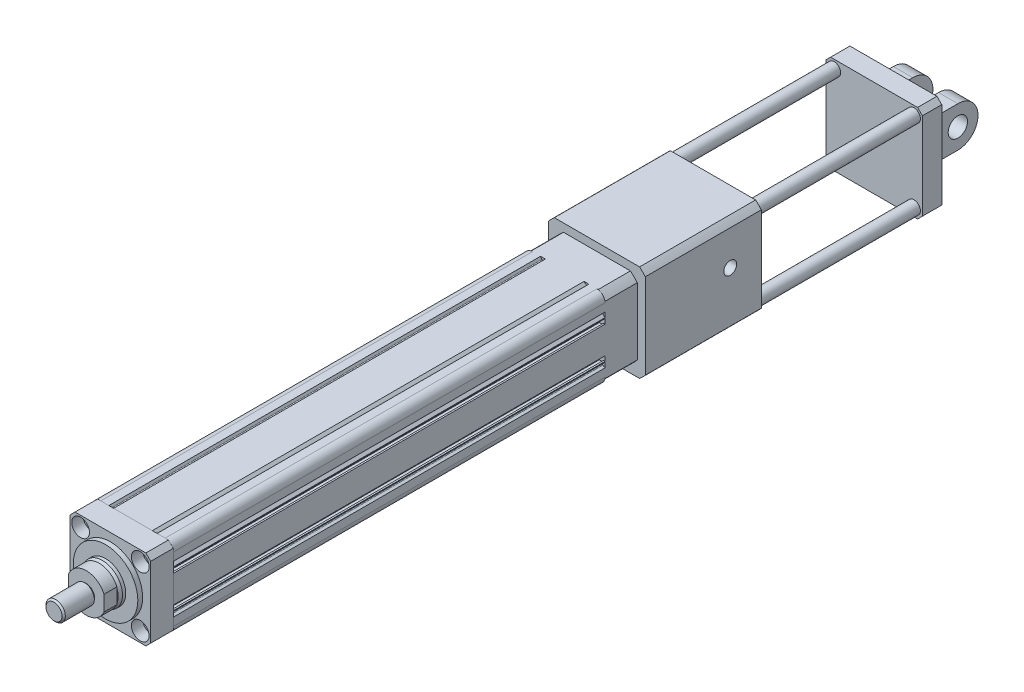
from build123d import *

# Parameters (mm, degrees)
SKETCH_1_R                  = 20
SKETCH_1_R_2                = 2.75
EXTRUDE_1_DEPTH             = 268
FILLET_1_R                  = 5
EXTRUDE_2_DEPTH             = 14
SKETCH_3_R                  = 20
EXTRUDE_3_DEPTH             = 3
SKETCH_5_R                  = 12.5
EXTRUDE_4_DEPTH             = 4
CHAMFER_1_SIZE              = 2
CHAMFER_1_SIZE2             = 0.7
EXTRUDE_5_DEPTH             = 8
SKETCH_7_R                  = 5.15
EXTRUDE_6_DEPTH             = 1
SKETCH_8_R                  = 6
EXTRUDE_7_DEPTH             = 19
CHAMFER_2_SIZE              = 1
SKETCH_23_W                 = 50
SKETCH_23_H                 = 50
EXTRUDE_8_DEPTH             = 20
SKETCH_24_R                 = 42.5
SKETCH_24_R_2               = 32.5
CUT_EXTRUDE_1_DEPTH         = 20
SKETCH_28_W                 = 60
SKETCH_28_H                 = 60
EXTRUDE_9_DEPTH             = 72
SKETCH_4_R                  = 3.5
CUT_EXTRUDE_5_DEPTH         = 30
SKETCH_4_6_R                = 5.5
CUT_EXTRUDE_6_DEPTH         = 7
CUT_EXTRUDE_START           = -72
SKETCH_30_R                 = 3.5
CUT_EXTRUDE_7_DEPTH         = 72
SKETCH_30_4_R               = 5.5
CUT_EXTRUDE_8_DEPTH         = 50
HOLE_WIZARD_M5_1_AT_2_COUNT = 2
HOLE_WIZARD_M5_1_AT_2_PITCH = 49.497474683
HOLE_WIZARD_M5_1_AT_3_COUNT = 2
HOLE_WIZARD_M5_1_AT_3_PITCH = 70
HOLE_WIZARD_M5_1_AT_4_COUNT = 2
HOLE_WIZARD_M5_1_AT_4_PITCH = 49.497474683
SKETCH_33_R                 = 19
CUT_EXTRUDE_9_DEPTH         = 65
SKETCH_33_3_R               = 25
CUT_EXTRUDE_10_DEPTH        = 6.5
SKETCH_34_R                 = 50
SKETCH_34_R_2               = 40
CUT_EXTRUDE_2_DEPTH         = 72
SKETCH_35_R                 = 4
CUT_EXTRUDE_11_DEPTH        = 22
SKETCH_36_R                 = 4
CUT_EXTRUDE_12_DEPTH        = 22
EXTRUDE_START               = 100
SKETCH_38_W                 = 60
SKETCH_38_H                 = 60
EXTRUDE_10_DEPTH            = 12
SKETCH_39_R                 = 4
EXTRUDE_11_DEPTH            = 112
EXTRUDE_11_2_DEPTH          = 112
EXTRUDE_11_3_DEPTH          = 112
EXTRUDE_11_4_DEPTH          = 112
EXTRUDE_12_DEPTH            = 1
SKETCH_41_W                 = 12
SKETCH_41_H                 = 25
EXTRUDE_13_DEPTH            = 32.5
SKETCH_42_R                 = 6
CUT_EXTRUDE_13_DEPTH        = 50
CHAMFER_3_SIZE              = 2
CHAMFER_4_SIZE              = 3


with BuildPart() as part:
    # Sketch 1 → Extrude 1 (new body)
    with BuildSketch(Plane.XY):
        with BuildLine():
            Line((-25, 25), (-15, 25))
            Line((-15, 25), (-14.227730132, 23.662389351))
            ThreePointArc((-14.227730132, 23.662389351), (-13.859980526, 23.416666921), (-13.441164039, 23.558835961))
            Line((-13.441164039, 23.558835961), (-12, 25))
            Line((-12, 25), (12, 25))
            Line((12, 25), (13.441164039, 23.558835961))
            ThreePointArc((13.441164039, 23.558835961), (13.859980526, 23.416666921), (14.227730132, 23.662389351))
            Line((14.227730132, 23.662389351), (15, 25))
            Line((15, 25), (25, 25))
            Line((25, 25), (25, 15))
            Line((25, 15), (23.662389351, 14.227730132))
            ThreePointArc((23.662389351, 14.227730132), (23.416666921, 13.859980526), (23.558835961, 13.441164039))
            Line((23.558835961, 13.441164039), (25, 12))
            Line((25, 12), (25, 11.5))
            Line((25, 11.5), (24, 11.5))
            Line((24, 11.5), (24, 12.4))
            Line((24, 12.4), (21.5, 12.4))
            Line((21.5, 12.4), (21.5, 7.6))
            Line((21.5, 7.6), (24, 7.6))
            Line((24, 7.6), (24, 8.5))
            Line((24, 8.5), (25, 8.5))
            Line((25, 8.5), (25, -8.5))
            Line((25, -8.5), (24, -8.5))
            Line((24, -8.5), (24, -7.6))
            Line((24, -7.6), (21.5, -7.6))
            Line((21.5, -7.6), (21.5, -12.4))
            Line((21.5, -12.4), (24, -12.4))
            Line((24, -12.4), (24, -11.5))
            Line((24, -11.5), (25, -11.5))
            Line((25, -11.5), (25, -12))
            Line((25, -12), (23.558835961, -13.441164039))
            ThreePointArc((23.558835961, -13.441164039), (23.416666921, -13.859980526), (23.662389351, -14.227730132))
            Line((23.662389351, -14.227730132), (25, -15))
            Line((25, -15), (25, -25))
            Line((25, -25), (15, -25))
            Line((15, -25), (14.227730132, -23.662389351))
            ThreePointArc((14.227730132, -23.662389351), (13.859980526, -23.416666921), (13.441164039, -23.558835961))
            Line((13.441164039, -23.558835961), (12, -25))
            Line((12, -25), (11.5, -25))
            Line((11.5, -25), (11.5, -24))
            Line((11.5, -24), (12.4, -24))
            Line((12.4, -24), (12.4, -21.5))
            Line((12.4, -21.5), (7.6, -21.5))
            Line((7.6, -21.5), (7.6, -24))
            Line((7.6, -24), (8.5, -24))
            Line((8.5, -24), (8.5, -25))
            Line((8.5, -25), (-8.5, -25))
            Line((-8.5, -25), (-8.5, -24))
            Line((-8.5, -24), (-7.6, -24))
            Line((-7.6, -24), (-7.6, -21.5))
            Line((-7.6, -21.5), (-12.4, -21.5))
            Line((-12.4, -21.5), (-12.4, -24))
            Line((-12.4, -24), (-11.5, -24))
            Line((-11.5, -24), (-11.5, -25))
            Line((-11.5, -25), (-12, -25))
            Line((-12, -25), (-13.441164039, -23.558835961))
            ThreePointArc((-13.441164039, -23.558835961), (-13.859980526, -23.416666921), (-14.227730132, -23.662389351))
            Line((-14.227730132, -23.662389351), (-15, -25))
            Line((-15, -25), (-25, -25))
            Line((-25, -25), (-25, -15))
            Line((-25, -15), (-23.662389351, -14.227730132))
            ThreePointArc((-23.662389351, -14.227730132), (-23.416666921, -13.859980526), (-23.558835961, -13.441164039))
            Line((-23.558835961, -13.441164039), (-25, -12))
            Line((-25, -12), (-25, -11.5))
            Line((-25, -11.5), (-24, -11.5))
            Line((-24, -11.5), (-24, -12.4))
            Line((-24, -12.4), (-21.5, -12.4))
            Line((-21.5, -12.4), (-21.5, -7.6))
            Line((-21.5, -7.6), (-24, -7.6))
            Line((-24, -7.6), (-24, -8.5))
            Line((-24, -8.5), (-25, -8.5))
            Line((-25, -8.5), (-25, 8.5))
            Line((-25, 8.5), (-24, 8.5))
            Line((-24, 8.5), (-24, 7.6))
            Line((-24, 7.6), (-21.5, 7.6))
            Line((-21.5, 7.6), (-21.5, 12.4))
            Line((-21.5, 12.4), (-24, 12.4))
            Line((-24, 12.4), (-24, 11.5))
            Line((-24, 11.5), (-25, 11.5))
            Line((-25, 11.5), (-25, 12))
            Line((-25, 12), (-23.558835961, 13.441164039))
            ThreePointArc((-23.558835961, 13.441164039), (-23.416666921, 13.859980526), (-23.662389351, 14.227730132))
            Line((-23.662389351, 14.227730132), (-25, 15))
            Line((-25, 15), (-25, 25))
        make_face()
        Circle(SKETCH_1_R, mode=Mode.SUBTRACT)
        with Locations((-18.5, 18.5)):
            Circle(SKETCH_1_R_2, mode=Mode.SUBTRACT)
        with Locations((18.5, 18.5)):
            Circle(SKETCH_1_R_2, mode=Mode.SUBTRACT)
        with Locations((18.5, -18.5)):
            Circle(SKETCH_1_R_2, mode=Mode.SUBTRACT)
        with Locations((-18.5, -18.5)):
            Circle(SKETCH_1_R_2, mode=Mode.SUBTRACT)
        with BuildLine():
            Line((-13.868836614, 23), (-5, 23))
            ThreePointArc((-5, 23), (-4.502985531, 22.554558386), (-4.891534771, 22.01190647))
            ThreePointArc((-4.891534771, 22.01190647), (-10.498377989, 19.955831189), (-15.368836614, 16.5))
            Line((-15.368836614, 16.5), (-15.368836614, 21.5))
            Line((-15.368836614, 21.5), (-13.868836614, 23))
        make_face(mode=Mode.SUBTRACT)
        with BuildLine():
            Line((15.368836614, 16.5), (15.368836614, 21.5))
            Line((15.368836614, 21.5), (13.868836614, 23))
            Line((13.868836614, 23), (5, 23))
            ThreePointArc((5, 23), (4.502985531, 22.554558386), (4.891534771, 22.01190647))
            ThreePointArc((4.891534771, 22.01190647), (10.498377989, 19.955831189), (15.368836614, 16.5))
        make_face(mode=Mode.SUBTRACT)
    extrude(amount=EXTRUDE_1_DEPTH)

    # Fillet 1
    fillet_1_edges = [part.edges().sort_by_distance(p)[0] for p in [
        (-25, 25, 134),
        (25, 25, 134),
        (25, -25, 134),
        (-25, -25, 134),
    ]]
    fillet(fillet_1_edges, radius=FILLET_1_R)

    # Sketch 23 → Extrude 8 (add)
    with BuildSketch(Plane(origin=(0, 0, 0), x_dir=(-1, 0, 0), z_dir=(0, 0, -1))):
        Rectangle(SKETCH_23_W, SKETCH_23_H)
    extrude(amount=EXTRUDE_8_DEPTH)

    # Sketch 24 → Cut-Extrude 1 (cut)
    with BuildSketch(Plane(origin=(0, 0, -20), x_dir=(-1, 0, 0), z_dir=(0, 0, -1))):
        Circle(SKETCH_24_R)
        Circle(SKETCH_24_R_2, mode=Mode.SUBTRACT)
    extrude(amount=-CUT_EXTRUDE_1_DEPTH, mode=Mode.SUBTRACT)

    # Sketch 27 → Hole Wizard M6 _1 (revolve, cut)
    with BuildSketch(Plane(origin=(0, -25, -12), x_dir=(0, 0, -1), z_dir=(1, 0, 0))):
        Polygon((0, 0), (0, 8.502151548), (2.5, 7), (2.5, 0), align=None)
    revolve(axis=Axis((0, -31.35, -12), (0, 1, 0)), mode=Mode.SUBTRACT)


with BuildPart() as body_2:
    # Sketch 2 → Extrude 2 (new body)
    with BuildSketch(Plane.XY.offset(268)):
        Polygon((-25, 22), (-22, 25), (22, 25), (25, 22), (25, -22), (22, -25), (-22, -25), (-25, -22), align=None)
    extrude(amount=EXTRUDE_2_DEPTH)


with BuildPart() as body_3:
    # Sketch 3 → Extrude 3 (new body)
    with BuildSketch(Plane.XY.offset(282)):
        Circle(SKETCH_3_R)
    extrude(amount=EXTRUDE_3_DEPTH)


with BuildPart() as body_4:
    # Sketch 5 → Extrude 4 (new body)
    with BuildSketch(Plane.XY.offset(285)):
        Circle(SKETCH_5_R)
    extrude(amount=EXTRUDE_4_DEPTH)

    # Chamfer 1
    chamfer_1_edges = [body_4.edges().sort_by_distance(p)[0] for p in [
        (-12.5, 0, 289),
    ]]
    chamfer_1_side = [body_4.faces().sort_by_distance(p)[0] for p in [
        (-12.5, 0, 287),
    ]]
    chamfer(chamfer_1_edges, length=CHAMFER_1_SIZE, length2=CHAMFER_1_SIZE2, reference=chamfer_1_side[0])


with BuildPart() as body_5:
    # Sketch 6 → Extrude 5 (new body)
    with BuildSketch(Plane.XY.offset(289)):
        with BuildLine():
            Line((-11, 4.795831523), (-11, -4.795831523))
            ThreePointArc((-11, -4.795831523), (0, -12), (11, -4.795831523))
            Line((11, -4.795831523), (11, 4.795831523))
            ThreePointArc((11, 4.795831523), (0, 12), (-11, 4.795831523))
        make_face()
    extrude(amount=EXTRUDE_5_DEPTH)


with BuildPart() as body_6:
    # Sketch 7 → Extrude 6 (new body)
    with BuildSketch(Plane.XY.offset(297)):
        Circle(SKETCH_7_R)
    extrude(amount=EXTRUDE_6_DEPTH)


with BuildPart() as body_7:
    # Sketch 8 → Extrude 7 (new body)
    with BuildSketch(Plane.XY.offset(298)):
        Circle(SKETCH_8_R)
    extrude(amount=EXTRUDE_7_DEPTH)

    # Chamfer 2
    chamfer_2_edges = [body_7.edges().sort_by_distance(p)[0] for p in [
        (-6, 0, 317),
    ]]
    chamfer(chamfer_2_edges, length=CHAMFER_2_SIZE)


with BuildPart() as body_8:
    # Sketch 28 → Extrude 9 (new body)
    with BuildSketch(Plane(origin=(0, 0, -20), x_dir=(-1, 0, 0), z_dir=(0, 0, -1))):
        Rectangle(SKETCH_28_W, SKETCH_28_H)
    extrude(amount=EXTRUDE_9_DEPTH)

    # Sketch 30 → Cut-Extrude 7 (cut)
    with BuildSketch(Plane(origin=(0, 0, -92), x_dir=(-1, 0, 0), z_dir=(0, 0, -1)).offset(CUT_EXTRUDE_START)):
        with Locations((-16.099900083, 18.5)):
            Circle(SKETCH_30_R)
        with Locations((19.700049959, 17.299950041)):
            Circle(SKETCH_30_R)
        with Locations((18.5, -18.5)):
            Circle(SKETCH_30_R)
        with Locations((-17.299950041, -17.299950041)):
            Circle(SKETCH_30_R)
    extrude(amount=CUT_EXTRUDE_7_DEPTH, mode=Mode.SUBTRACT)

    # Sketch 30_4 → Cut-Extrude 8 (cut)
    with BuildSketch(Plane(origin=(0, 0, -92), x_dir=(-1, 0, 0), z_dir=(0, 0, -1))):
        with Locations((18.5, -18.5)):
            Circle(SKETCH_30_4_R)
        with Locations((-17.299950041, -17.299950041)):
            Circle(SKETCH_30_4_R)
        with Locations((-16.099900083, 18.5)):
            Circle(SKETCH_30_4_R)
        with Locations((19.700049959, 17.299950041)):
            Circle(SKETCH_30_4_R)
    extrude(amount=-CUT_EXTRUDE_8_DEPTH, mode=Mode.SUBTRACT)

    # Sketch 32 → Hole Wizard M5 _1 (revolve, cut)
    with BuildSketch(Plane(origin=(-24.748737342, -24.748737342, -92), x_dir=(0, 1, 0), z_dir=(1, 0, 0))):
        Polygon((0, 0), (0, 15.2618073), (2.1, 14), (2.1, 0), align=None)
    hole_wizard_m5_1 = revolve(axis=Axis((-24.748737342, -24.748737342, -98.35), (0, 0, 1)), mode=Mode.SUBTRACT)

    # Hole Wizard M5 _1 at 2: Hole Wizard M5 _1 ×2
    with Locations(*[(i * HOLE_WIZARD_M5_1_AT_2_PITCH, 0, 0) for i in range(1, HOLE_WIZARD_M5_1_AT_2_COUNT)]):
        add(hole_wizard_m5_1, mode=Mode.SUBTRACT)

    # Hole Wizard M5 _1 at 3: Hole Wizard M5 _1 ×2
    with Locations(*[Vector(0.7071067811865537, 0.7071067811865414, 0) * (i * HOLE_WIZARD_M5_1_AT_3_PITCH) for i in range(1, HOLE_WIZARD_M5_1_AT_3_COUNT)]):
        add(hole_wizard_m5_1, mode=Mode.SUBTRACT)

    # Hole Wizard M5 _1 at 4: Hole Wizard M5 _1 ×2
    with Locations(*[(0, i * HOLE_WIZARD_M5_1_AT_4_PITCH, 0) for i in range(1, HOLE_WIZARD_M5_1_AT_4_COUNT)]):
        add(hole_wizard_m5_1, mode=Mode.SUBTRACT)

    # Sketch 33 → Cut-Extrude 9 (cut)
    with BuildSketch(Plane(origin=(0, 0, -92), x_dir=(-1, 0, 0), z_dir=(0, 0, -1))):
        Circle(SKETCH_33_R)
    extrude(amount=-CUT_EXTRUDE_9_DEPTH, mode=Mode.SUBTRACT)

    # Sketch 33_3 → Cut-Extrude 10 (cut)
    with BuildSketch(Plane(origin=(0, 0, -92), x_dir=(-1, 0, 0), z_dir=(0, 0, -1))):
        Circle(SKETCH_33_3_R)
    extrude(amount=-CUT_EXTRUDE_10_DEPTH, mode=Mode.SUBTRACT)

    # Sketch 34 → Cut-Extrude 2 (cut)
    with BuildSketch(Plane(origin=(0, 0, -92), x_dir=(-1, 0, 0), z_dir=(0, 0, -1))):
        Circle(SKETCH_34_R)
        Circle(SKETCH_34_R_2, mode=Mode.SUBTRACT)
    extrude(amount=-CUT_EXTRUDE_2_DEPTH, mode=Mode.SUBTRACT)

    # Sketch 35 → Cut-Extrude 11 (cut)
    with BuildSketch(Plane(origin=(30, 0, 0), x_dir=(0, 0, -1), z_dir=(1, 0, 0))):
        with Locations((72.713697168, 4.902306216)):
            Circle(SKETCH_35_R)
    extrude(amount=-CUT_EXTRUDE_11_DEPTH, mode=Mode.SUBTRACT)

    # Sketch 36 → Cut-Extrude 12 (cut)
    with BuildSketch(Plane.ZY.offset(30)):
        with Locations((-37.731412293, -10.555978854)):
            Circle(SKETCH_36_R)
    extrude(amount=-CUT_EXTRUDE_12_DEPTH, mode=Mode.SUBTRACT)



with BuildPart() as cut_extrude_5_tool:
    # Sketch 4 → Cut-Extrude 5 (new body)
    with BuildSketch(Plane.XY.offset(282)):
        with Locations((-35, 17.5)):
            Circle(SKETCH_4_R)
        with Locations((-18.5, 18.5)):
            Circle(SKETCH_4_R)
        with Locations(Location((-18.5, -18.5, 0), (0, 0, 180))):
            Circle(SKETCH_4_R)
        with Locations((-35, -17.5)):
            Circle(SKETCH_4_R)
        with Locations((35, -17.5)):
            Circle(SKETCH_4_R)
        with Locations((18.5, -18.5)):
            Circle(SKETCH_4_R)
        with Locations(Location((18.5, 18.5, 0), (0, 0, 180))):
            Circle(SKETCH_4_R)
        with Locations((35, 17.5)):
            Circle(SKETCH_4_R)
    extrude(amount=-CUT_EXTRUDE_5_DEPTH)


with BuildPart() as part_1:
    add(part.part)

    # Cut-Extrude 5: cut by cut_extrude_5_tool
    add(cut_extrude_5_tool.part, mode=Mode.SUBTRACT)


with BuildPart() as body_2_1:
    add(body_2.part)

    # Cut-Extrude 5: cut by cut_extrude_5_tool
    add(cut_extrude_5_tool.part, mode=Mode.SUBTRACT)

    # Sketch 4_6 → Cut-Extrude 6 (cut)
    with BuildSketch(Plane.XY.offset(282)):
        with Locations((-18.5, 18.5)):
            Circle(SKETCH_4_6_R)
        with Locations(Location((-18.5, -18.5, 0), (0, 0, 180))):
            Circle(SKETCH_4_6_R)
        with Locations((18.5, -18.5)):
            Circle(SKETCH_4_6_R)
        with Locations(Location((18.5, 18.5, 0), (0, 0, 180))):
            Circle(SKETCH_4_6_R)
    extrude(amount=-CUT_EXTRUDE_6_DEPTH, mode=Mode.SUBTRACT)


with BuildPart() as body_9:
    # Sketch 38 → Extrude 10 (new body)
    with BuildSketch(Plane(origin=(0, 0, -92), x_dir=(-1, 0, 0), z_dir=(0, 0, -1)).offset(EXTRUDE_START)):
        Rectangle(SKETCH_38_W, SKETCH_38_H)
    extrude(amount=EXTRUDE_10_DEPTH)



with BuildPart() as body_10:
    # Sketch 39 → Extrude 11 (new body)
    with BuildSketch(Plane(origin=(0, 0, -204), x_dir=(-1, 0, 0), z_dir=(0, 0, -1))):
        with Locations((-24.748737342, 24.748737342)):
            Circle(SKETCH_39_R)
    extrude(amount=-EXTRUDE_11_DEPTH)


with BuildPart() as body_11:
    # Sketch 39 → Extrude 11 2 (new body)
    with BuildSketch(Plane(origin=(0, 0, -204), x_dir=(-1, 0, 0), z_dir=(0, 0, -1))):
        with Locations((24.748737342, 24.748737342)):
            Circle(SKETCH_39_R)
    extrude(amount=-EXTRUDE_11_2_DEPTH)


with BuildPart() as body_12:
    # Sketch 39 → Extrude 11 3 (new body)
    with BuildSketch(Plane(origin=(0, 0, -204), x_dir=(-1, 0, 0), z_dir=(0, 0, -1))):
        with Locations((-24.748737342, -24.748737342)):
            Circle(SKETCH_39_R)
    extrude(amount=-EXTRUDE_11_3_DEPTH)


with BuildPart() as body_13:
    # Sketch 39 → Extrude 11 4 (new body)
    with BuildSketch(Plane(origin=(0, 0, -204), x_dir=(-1, 0, 0), z_dir=(0, 0, -1))):
        with Locations((24.748737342, -24.748737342)):
            Circle(SKETCH_39_R)
    extrude(amount=-EXTRUDE_11_4_DEPTH)


with BuildPart() as body_8_1:
    add(body_8.part)

    add(body_10.part)  # Extrude 12 merges body 10

    add(body_11.part)  # Extrude 12 merges body 11

    add(body_12.part)  # Extrude 12 merges body 12

    add(body_13.part)  # Extrude 12 merges body 13
    # Sketch 40 → Extrude 12 (add)
    with BuildSketch(Plane(origin=(0, 0, -92), x_dir=(-1, 0, 0), z_dir=(0, 0, -1))):
        with BuildLine():
            ThreePointArc((-11.862525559, 22.006373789), (-19.710535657, 22.648892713), (-20.157746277, 14.787334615))
            ThreePointArc((-20.157746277, 14.787334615), (-24.984992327, 0.866116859), (-21.133347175, -13.355958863))
            ThreePointArc((-21.133347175, -13.355958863), (-21.189037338, -21.189037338), (-13.355958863, -21.133347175))
            ThreePointArc((-13.355958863, -21.133347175), (0.140128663, -24.999607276), (13.592026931, -20.982297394))
            ThreePointArc((13.592026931, -20.982297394), (22.389087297, -22.389087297), (20.982297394, -13.592026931))
            ThreePointArc((20.982297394, -13.592026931), (24.987170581, -0.800816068), (21.809568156, 12.220586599))
            ThreePointArc((21.809568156, 12.220586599), (23.832727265, 20.929134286), (14.935785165, 20.048000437))
            ThreePointArc((14.935785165, 20.048000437), (1.822097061, 24.93351083), (-11.862525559, 22.006373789))
        make_face()
    extrude(amount=-EXTRUDE_12_DEPTH)


with BuildPart() as body_9_1:
    add(body_9.part)

    add(body_8_1.part)  # Extrude 13 merges body 8
    # Sketch 41 → Extrude 13 (add)
    with BuildSketch(Plane(origin=(0, 0, -204), x_dir=(-1, 0, 0), z_dir=(0, 0, -1))):
        with Locations((14, 0)):
            Rectangle(SKETCH_41_W, SKETCH_41_H)
        with Locations((-14, 0)):
            Rectangle(SKETCH_41_W, SKETCH_41_H)
    extrude(amount=EXTRUDE_13_DEPTH)

    # Sketch 42 → Cut-Extrude 13 (cut)
    with BuildSketch(Plane(origin=(20, 0, 0), x_dir=(0, 0, -1), z_dir=(1, 0, 0))):
        with Locations(Location((224, 0, 0), (0, 0, 90))):
            Circle(SKETCH_42_R)
        with BuildLine():
            Line((224, -12.5), (244.505550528, -18.954150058))
            Line((244.505550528, -18.954150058), (245.960673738, 16.090067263))
            Line((245.960673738, 16.090067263), (224, 12.5))
            ThreePointArc((224, 12.5), (236.5, 0), (224, -12.5))
        make_face()
    extrude(amount=-CUT_EXTRUDE_13_DEPTH, mode=Mode.SUBTRACT)

    # Chamfer 3
    chamfer_3_edges = [body_9_1.edges().sort_by_distance(p)[0] for p in [
        (-8, 0, -204),
        (-14, -12.5, -204),
        (-20, 0, -204),
        (-14, 12.5, -204),
        (20, 0, -204),
        (14, -12.5, -204),
        (8, 0, -204),
        (14, 12.5, -204),
    ]]
    chamfer(chamfer_3_edges, length=CHAMFER_3_SIZE)

    # Chamfer 4
    chamfer_4_edges = [body_9_1.edges().sort_by_distance(p)[0] for p in [
        (-30, -30, -198),
        (30, -30, -198),
        (30, 30, -198),
        (-30, 30, -198),
    ]]
    chamfer(chamfer_4_edges, length=CHAMFER_4_SIZE)


solid = Compound([body_3.part, body_4.part, body_5.part, body_6.part, body_7.part, part_1.part, body_2_1.part, body_9_1.part])
